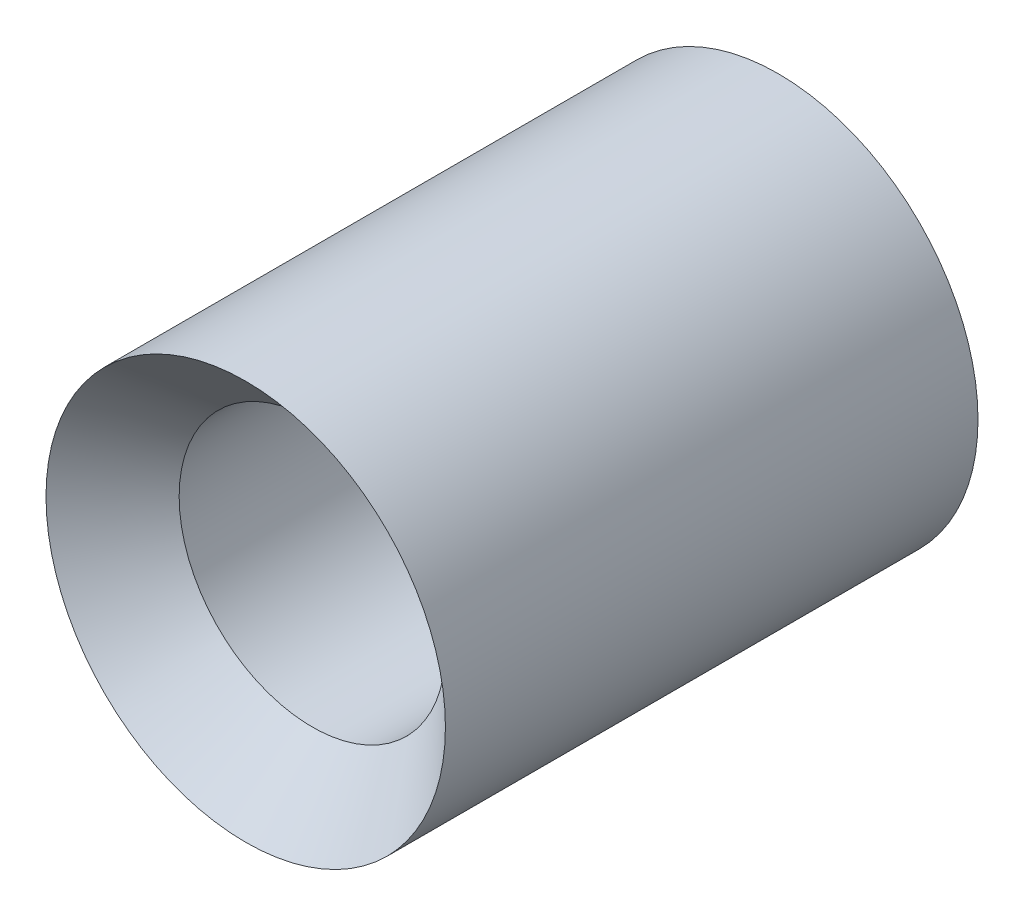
ISO-10303-21;
HEADER;
FILE_DESCRIPTION(('STEP AP214'),'2;1');
FILE_NAME('part.step','',(''),(''),'','','');
FILE_SCHEMA(('AUTOMOTIVE_DESIGN { 1 0 10303 214 1 1 1 1 }'));
ENDSEC;
DATA;
#1=APPLICATION_CONTEXT('core data for automotive mechanical design processes');
#2=APPLICATION_PROTOCOL_DEFINITION('international standard','automotive_design',2000,#1);
#3=PRODUCT_CONTEXT('',#1,'mechanical');
#4=PRODUCT('Part','Part','',(#3));
#5=PRODUCT_RELATED_PRODUCT_CATEGORY('part','',(#4));
#6=PRODUCT_DEFINITION_FORMATION('','',#4);
#7=PRODUCT_DEFINITION_CONTEXT('part definition',#1,'design');
#8=PRODUCT_DEFINITION('design','',#6,#7);
#9=PRODUCT_DEFINITION_SHAPE('','',#8);
#10=(LENGTH_UNIT() NAMED_UNIT(*) SI_UNIT(.MILLI.,.METRE.));
#11=(NAMED_UNIT(*) PLANE_ANGLE_UNIT() SI_UNIT($,.RADIAN.));
#12=(NAMED_UNIT(*) SI_UNIT($,.STERADIAN.) SOLID_ANGLE_UNIT());
#13=UNCERTAINTY_MEASURE_WITH_UNIT(LENGTH_MEASURE(1.E-05),#10,'distance_accuracy_value','');
#14=(GEOMETRIC_REPRESENTATION_CONTEXT(3) GLOBAL_UNCERTAINTY_ASSIGNED_CONTEXT((#13)) GLOBAL_UNIT_ASSIGNED_CONTEXT((#10,
#11,#12)) REPRESENTATION_CONTEXT('',''));
#15=CARTESIAN_POINT('',(0.,0.,0.));
#16=DIRECTION('',(0.,0.,1.));
#17=DIRECTION('',(1.,0.,0.));
#18=AXIS2_PLACEMENT_3D('',#15,#16,#17);
#19=CARTESIAN_POINT('',(0.,0.,0.));
#20=DIRECTION('',(0.,0.,1.));
#21=DIRECTION('',(1.,0.,0.));
#22=AXIS2_PLACEMENT_3D('',#19,#20,#21);
#23=PLANE('',#22);
#24=CARTESIAN_POINT('',(0.,0.,0.));
#25=DIRECTION('',(0.,0.,1.));
#26=DIRECTION('',(1.,0.,0.));
#27=AXIS2_PLACEMENT_3D('',#24,#25,#26);
#28=CIRCLE('',#27,7.5);
#29=CARTESIAN_POINT('',(7.5,0.,0.));
#30=VERTEX_POINT('',#29);
#31=EDGE_CURVE('E46',#30,#30,#28,.T.);
#32=ORIENTED_EDGE('',*,*,#31,.F.);
#33=EDGE_LOOP('',(#32));
#34=FACE_BOUND('',#33,.T.);
#35=CARTESIAN_POINT('',(0.,0.,0.));
#36=DIRECTION('',(0.,0.,1.));
#37=DIRECTION('',(1.,0.,0.));
#38=AXIS2_PLACEMENT_3D('',#35,#36,#37);
#39=CIRCLE('',#38,5.);
#40=CARTESIAN_POINT('',(5.,0.,0.));
#41=VERTEX_POINT('',#40);
#42=EDGE_CURVE('E51',#41,#41,#39,.T.);
#43=ORIENTED_EDGE('',*,*,#42,.T.);
#44=EDGE_LOOP('',(#43));
#45=FACE_BOUND('',#44,.T.);
#46=ADVANCED_FACE('F35',(#34,#45),#23,.F.);
#47=CARTESIAN_POINT('',(0.,0.,20.));
#48=DIRECTION('',(0.,0.,-1.));
#49=DIRECTION('',(-1.,0.,0.));
#50=AXIS2_PLACEMENT_3D('',#47,#48,#49);
#51=CYLINDRICAL_SURFACE('',#50,7.5);
#52=CARTESIAN_POINT('',(0.,0.,20.));
#53=DIRECTION('',(0.,0.,1.));
#54=DIRECTION('',(1.,0.,0.));
#55=AXIS2_PLACEMENT_3D('',#52,#53,#54);
#56=CIRCLE('',#55,7.5);
#57=CARTESIAN_POINT('',(7.5,0.,20.));
#58=VERTEX_POINT('',#57);
#59=EDGE_CURVE('E42',#58,#58,#56,.T.);
#60=ORIENTED_EDGE('',*,*,#59,.F.);
#61=EDGE_LOOP('',(#60));
#62=FACE_BOUND('',#61,.T.);
#63=ORIENTED_EDGE('',*,*,#31,.T.);
#64=EDGE_LOOP('',(#63));
#65=FACE_BOUND('',#64,.T.);
#66=ADVANCED_FACE('F59',(#62,#65),#51,.T.);
#67=CARTESIAN_POINT('',(0.,0.,20.));
#68=DIRECTION('',(0.,0.,-1.));
#69=DIRECTION('',(-1.,0.,0.));
#70=AXIS2_PLACEMENT_3D('',#67,#68,#69);
#71=CYLINDRICAL_SURFACE('',#70,5.);
#72=CARTESIAN_POINT('',(0.,0.,17.5));
#73=DIRECTION('',(0.,0.,1.));
#74=DIRECTION('',(1.,0.,0.));
#75=AXIS2_PLACEMENT_3D('',#72,#73,#74);
#76=CIRCLE('',#75,5.);
#77=CARTESIAN_POINT('',(5.,0.,17.5));
#78=VERTEX_POINT('',#77);
#79=EDGE_CURVE('E10',#78,#78,#76,.T.);
#80=ORIENTED_EDGE('',*,*,#79,.T.);
#81=EDGE_LOOP('',(#80));
#82=FACE_BOUND('',#81,.T.);
#83=ORIENTED_EDGE('',*,*,#42,.F.);
#84=EDGE_LOOP('',(#83));
#85=FACE_BOUND('',#84,.T.);
#86=ADVANCED_FACE('F57',(#82,#85),#71,.F.);
#87=CARTESIAN_POINT('',(0.,0.,17.5));
#88=DIRECTION('',(0.,0.,1.));
#89=DIRECTION('',(1.,0.,0.));
#90=AXIS2_PLACEMENT_3D('',#87,#88,#89);
#91=CONICAL_SURFACE('',#90,5.,0.785398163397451);
#92=ORIENTED_EDGE('',*,*,#59,.T.);
#93=EDGE_LOOP('',(#92));
#94=FACE_BOUND('',#93,.T.);
#95=ORIENTED_EDGE('',*,*,#79,.F.);
#96=EDGE_LOOP('',(#95));
#97=FACE_BOUND('',#96,.T.);
#98=ADVANCED_FACE('F37',(#94,#97),#91,.F.);
#99=CLOSED_SHELL('',(#46,#66,#86,#98));
#100=MANIFOLD_SOLID_BREP('B2',#99);
#101=ADVANCED_BREP_SHAPE_REPRESENTATION('',(#18,#100),#14);
#102=SHAPE_DEFINITION_REPRESENTATION(#9,#101);
ENDSEC;
END-ISO-10303-21;
